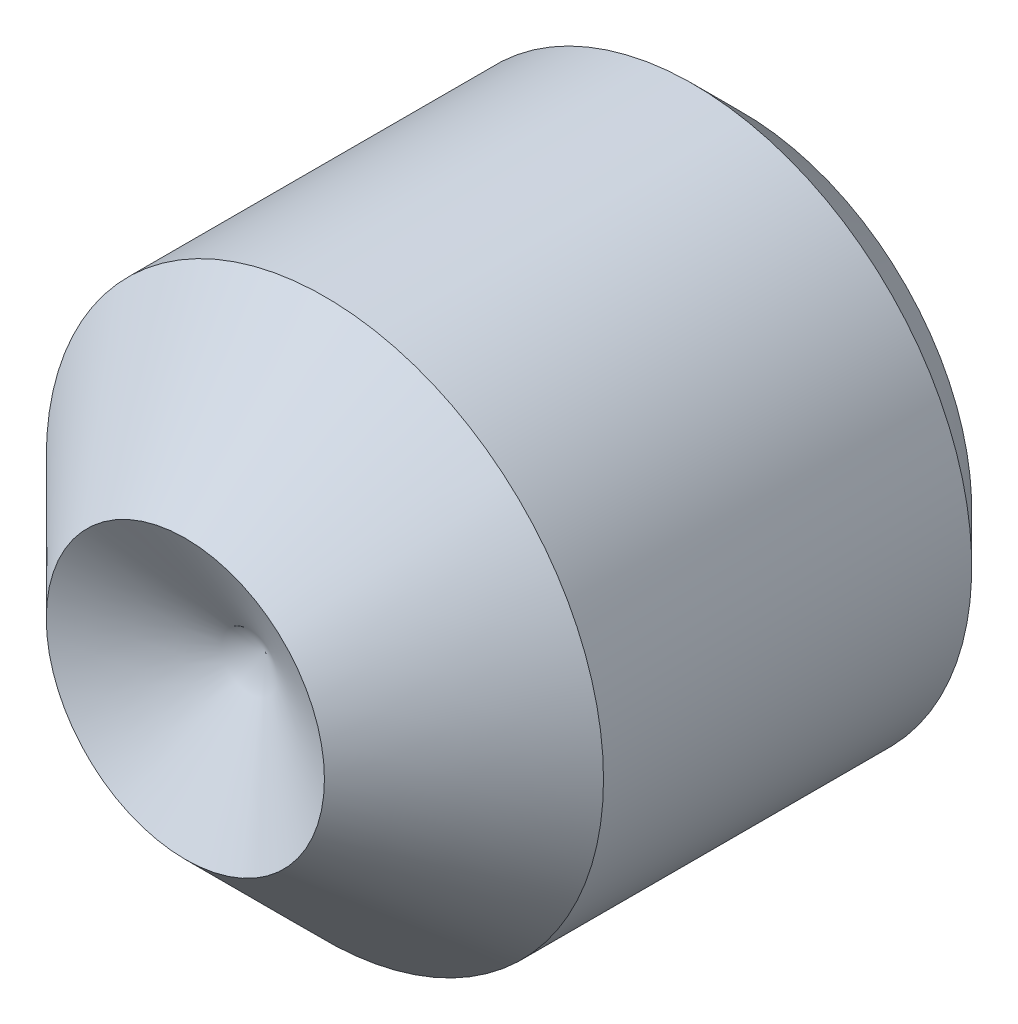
ISO-10303-21;
HEADER;
FILE_DESCRIPTION(('STEP AP214'),'2;1');
FILE_NAME('part.step','',(''),(''),'','','');
FILE_SCHEMA(('AUTOMOTIVE_DESIGN { 1 0 10303 214 1 1 1 1 }'));
ENDSEC;
DATA;
#1=APPLICATION_CONTEXT('core data for automotive mechanical design processes');
#2=APPLICATION_PROTOCOL_DEFINITION('international standard','automotive_design',2000,#1);
#3=PRODUCT_CONTEXT('',#1,'mechanical');
#4=PRODUCT('Part','Part','',(#3));
#5=PRODUCT_RELATED_PRODUCT_CATEGORY('part','',(#4));
#6=PRODUCT_DEFINITION_FORMATION('','',#4);
#7=PRODUCT_DEFINITION_CONTEXT('part definition',#1,'design');
#8=PRODUCT_DEFINITION('design','',#6,#7);
#9=PRODUCT_DEFINITION_SHAPE('','',#8);
#10=(LENGTH_UNIT() NAMED_UNIT(*) SI_UNIT(.MILLI.,.METRE.));
#11=(NAMED_UNIT(*) PLANE_ANGLE_UNIT() SI_UNIT($,.RADIAN.));
#12=(NAMED_UNIT(*) SI_UNIT($,.STERADIAN.) SOLID_ANGLE_UNIT());
#13=UNCERTAINTY_MEASURE_WITH_UNIT(LENGTH_MEASURE(1.E-05),#10,'distance_accuracy_value','');
#14=(GEOMETRIC_REPRESENTATION_CONTEXT(3) GLOBAL_UNCERTAINTY_ASSIGNED_CONTEXT((#13)) GLOBAL_UNIT_ASSIGNED_CONTEXT((#10,
#11,#12)) REPRESENTATION_CONTEXT('',''));
#15=CARTESIAN_POINT('',(0.,0.,0.));
#16=DIRECTION('',(0.,0.,1.));
#17=DIRECTION('',(1.,0.,0.));
#18=AXIS2_PLACEMENT_3D('',#15,#16,#17);
#19=CARTESIAN_POINT('',(0.,0.,-10.585154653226));
#20=DIRECTION('',(0.,0.,-1.));
#21=DIRECTION('',(-1.,0.,0.));
#22=AXIS2_PLACEMENT_3D('',#19,#20,#21);
#23=CYLINDRICAL_SURFACE('',#22,3.96875);
#24=CARTESIAN_POINT('',(0.,0.,0.704850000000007));
#25=DIRECTION('',(0.,0.,-1.));
#26=DIRECTION('',(-1.,0.,0.));
#27=AXIS2_PLACEMENT_3D('',#24,#25,#26);
#28=CIRCLE('',#27,3.96875);
#29=CARTESIAN_POINT('',(-3.96875,0.,0.704850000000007));
#30=VERTEX_POINT('',#29);
#31=EDGE_CURVE('E58',#30,#30,#28,.T.);
#32=ORIENTED_EDGE('',*,*,#31,.F.);
#33=EDGE_LOOP('',(#32));
#34=FACE_BOUND('',#33,.T.);
#35=CARTESIAN_POINT('',(0.,0.,5.94995000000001));
#36=DIRECTION('',(0.,0.,1.));
#37=DIRECTION('',(1.,0.,0.));
#38=AXIS2_PLACEMENT_3D('',#35,#36,#37);
#39=CIRCLE('',#38,3.96875);
#40=CARTESIAN_POINT('',(3.96875,0.,5.94995000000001));
#41=VERTEX_POINT('',#40);
#42=EDGE_CURVE('E188',#41,#41,#39,.T.);
#43=ORIENTED_EDGE('',*,*,#42,.F.);
#44=EDGE_LOOP('',(#43));
#45=FACE_BOUND('',#44,.T.);
#46=ADVANCED_FACE('F49',(#34,#45),#23,.T.);
#47=CARTESIAN_POINT('',(0.,0.,0.));
#48=DIRECTION('',(0.,0.,1.));
#49=DIRECTION('',(1.,0.,0.));
#50=AXIS2_PLACEMENT_3D('',#47,#48,#49);
#51=PLANE('',#50);
#52=DIRECTION('',(-0.5,-0.866025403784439,0.));
#53=VECTOR('',#52,1.);
#54=CARTESIAN_POINT('',(2.29062564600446,0.,0.));
#55=LINE('',#54,#53);
#56=CARTESIAN_POINT('',(2.29062564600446,0.,0.));
#57=VERTEX_POINT('',#56);
#58=CARTESIAN_POINT('',(1.14531282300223,-1.98374,0.));
#59=VERTEX_POINT('',#58);
#60=EDGE_CURVE('E148',#57,#59,#55,.T.);
#61=ORIENTED_EDGE('',*,*,#60,.F.);
#62=DIRECTION('',(0.499999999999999,-0.866025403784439,0.));
#63=VECTOR('',#62,1.);
#64=CARTESIAN_POINT('',(1.14531282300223,1.98374,0.));
#65=LINE('',#64,#63);
#66=CARTESIAN_POINT('',(1.14531282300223,1.98374,0.));
#67=VERTEX_POINT('',#66);
#68=EDGE_CURVE('E65',#67,#57,#65,.T.);
#69=ORIENTED_EDGE('',*,*,#68,.F.);
#70=DIRECTION('',(1.,0.,0.));
#71=VECTOR('',#70,1.);
#72=CARTESIAN_POINT('',(-1.14531282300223,1.98373999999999,0.));
#73=LINE('',#72,#71);
#74=CARTESIAN_POINT('',(-1.14531282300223,1.98373999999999,0.));
#75=VERTEX_POINT('',#74);
#76=EDGE_CURVE('E162',#75,#67,#73,.T.);
#77=ORIENTED_EDGE('',*,*,#76,.F.);
#78=DIRECTION('',(0.5,0.866025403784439,0.));
#79=VECTOR('',#78,1.);
#80=CARTESIAN_POINT('',(-2.29062564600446,0.,0.));
#81=LINE('',#80,#79);
#82=CARTESIAN_POINT('',(-2.29062564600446,0.,0.));
#83=VERTEX_POINT('',#82);
#84=EDGE_CURVE('E159',#83,#75,#81,.T.);
#85=ORIENTED_EDGE('',*,*,#84,.F.);
#86=DIRECTION('',(-0.5,0.866025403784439,0.));
#87=VECTOR('',#86,1.);
#88=CARTESIAN_POINT('',(-1.14531282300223,-1.98374,0.));
#89=LINE('',#88,#87);
#90=CARTESIAN_POINT('',(-1.14531282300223,-1.98374,0.));
#91=VERTEX_POINT('',#90);
#92=EDGE_CURVE('E115',#91,#83,#89,.T.);
#93=ORIENTED_EDGE('',*,*,#92,.F.);
#94=DIRECTION('',(-1.,0.,0.));
#95=VECTOR('',#94,1.);
#96=CARTESIAN_POINT('',(1.14531282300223,-1.98374,0.));
#97=LINE('',#96,#95);
#98=EDGE_CURVE('E153',#59,#91,#97,.T.);
#99=ORIENTED_EDGE('',*,*,#98,.F.);
#100=EDGE_LOOP('',(#61,#69,#77,#85,#93,#99));
#101=FACE_BOUND('',#100,.T.);
#102=CARTESIAN_POINT('',(0.,0.,0.));
#103=DIRECTION('',(0.,0.,-1.));
#104=DIRECTION('',(-1.,0.,0.));
#105=AXIS2_PLACEMENT_3D('',#102,#103,#104);
#106=CIRCLE('',#105,3.2639);
#107=CARTESIAN_POINT('',(-3.2639,0.,0.));
#108=VERTEX_POINT('',#107);
#109=EDGE_CURVE('E11',#108,#108,#106,.T.);
#110=ORIENTED_EDGE('',*,*,#109,.T.);
#111=EDGE_LOOP('',(#110));
#112=FACE_BOUND('',#111,.T.);
#113=ADVANCED_FACE('F51',(#101,#112),#51,.F.);
#114=CARTESIAN_POINT('',(0.,0.,0.704850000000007));
#115=DIRECTION('',(0.,0.,1.));
#116=DIRECTION('',(1.,0.,0.));
#117=AXIS2_PLACEMENT_3D('',#114,#115,#116);
#118=CONICAL_SURFACE('',#117,3.96875,0.785398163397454);
#119=ORIENTED_EDGE('',*,*,#109,.F.);
#120=EDGE_LOOP('',(#119));
#121=FACE_BOUND('',#120,.T.);
#122=ORIENTED_EDGE('',*,*,#31,.T.);
#123=EDGE_LOOP('',(#122));
#124=FACE_BOUND('',#123,.T.);
#125=ADVANCED_FACE('F181',(#121,#124),#118,.T.);
#126=CARTESIAN_POINT('',(1.14531282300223,1.98374,2.5));
#127=DIRECTION('',(0.866025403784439,0.499999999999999,0.));
#128=DIRECTION('',(-0.499999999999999,0.866025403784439,0.));
#129=AXIS2_PLACEMENT_3D('',#126,#127,#128);
#130=PLANE('',#129);
#131=ORIENTED_EDGE('',*,*,#68,.T.);
#132=DIRECTION('',(0.,0.,-1.));
#133=VECTOR('',#132,1.);
#134=CARTESIAN_POINT('',(2.29062564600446,0.,2.5));
#135=LINE('',#134,#133);
#136=CARTESIAN_POINT('',(2.29062564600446,0.,2.5));
#137=VERTEX_POINT('',#136);
#138=EDGE_CURVE('E96',#137,#57,#135,.T.);
#139=ORIENTED_EDGE('',*,*,#138,.F.);
#140=DIRECTION('',(0.499999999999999,-0.866025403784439,0.));
#141=VECTOR('',#140,1.);
#142=CARTESIAN_POINT('',(1.14531282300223,1.98374,2.5));
#143=LINE('',#142,#141);
#144=CARTESIAN_POINT('',(1.14531282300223,1.98374,2.5));
#145=VERTEX_POINT('',#144);
#146=EDGE_CURVE('E165',#145,#137,#143,.T.);
#147=ORIENTED_EDGE('',*,*,#146,.F.);
#148=DIRECTION('',(0.,0.,-1.));
#149=VECTOR('',#148,1.);
#150=CARTESIAN_POINT('',(1.14531282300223,1.98374,2.5));
#151=LINE('',#150,#149);
#152=EDGE_CURVE('E73',#145,#67,#151,.T.);
#153=ORIENTED_EDGE('',*,*,#152,.T.);
#154=EDGE_LOOP('',(#131,#139,#147,#153));
#155=FACE_BOUND('',#154,.T.);
#156=ADVANCED_FACE('F211',(#155),#130,.F.);
#157=CARTESIAN_POINT('',(-1.14531282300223,1.98373999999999,2.5));
#158=DIRECTION('',(0.,1.,0.));
#159=DIRECTION('',(-1.,0.,0.));
#160=AXIS2_PLACEMENT_3D('',#157,#158,#159);
#161=PLANE('',#160);
#162=ORIENTED_EDGE('',*,*,#76,.T.);
#163=ORIENTED_EDGE('',*,*,#152,.F.);
#164=DIRECTION('',(1.,0.,0.));
#165=VECTOR('',#164,1.);
#166=CARTESIAN_POINT('',(-1.14531282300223,1.98373999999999,2.5));
#167=LINE('',#166,#165);
#168=CARTESIAN_POINT('',(-1.14531282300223,1.98373999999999,2.5));
#169=VERTEX_POINT('',#168);
#170=EDGE_CURVE('E129',#169,#145,#167,.T.);
#171=ORIENTED_EDGE('',*,*,#170,.F.);
#172=DIRECTION('',(0.,0.,-1.));
#173=VECTOR('',#172,1.);
#174=CARTESIAN_POINT('',(-1.14531282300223,1.98373999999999,2.5));
#175=LINE('',#174,#173);
#176=EDGE_CURVE('E120',#169,#75,#175,.T.);
#177=ORIENTED_EDGE('',*,*,#176,.T.);
#178=EDGE_LOOP('',(#162,#163,#171,#177));
#179=FACE_BOUND('',#178,.T.);
#180=ADVANCED_FACE('F209',(#179),#161,.F.);
#181=CARTESIAN_POINT('',(-2.29062564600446,0.,2.5));
#182=DIRECTION('',(-0.866025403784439,0.5,0.));
#183=DIRECTION('',(-0.5,-0.866025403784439,0.));
#184=AXIS2_PLACEMENT_3D('',#181,#182,#183);
#185=PLANE('',#184);
#186=ORIENTED_EDGE('',*,*,#84,.T.);
#187=ORIENTED_EDGE('',*,*,#176,.F.);
#188=DIRECTION('',(0.5,0.866025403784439,0.));
#189=VECTOR('',#188,1.);
#190=CARTESIAN_POINT('',(-2.29062564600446,0.,2.5));
#191=LINE('',#190,#189);
#192=CARTESIAN_POINT('',(-2.29062564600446,0.,2.5));
#193=VERTEX_POINT('',#192);
#194=EDGE_CURVE('E124',#193,#169,#191,.T.);
#195=ORIENTED_EDGE('',*,*,#194,.F.);
#196=DIRECTION('',(0.,0.,-1.));
#197=VECTOR('',#196,1.);
#198=CARTESIAN_POINT('',(-2.29062564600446,0.,2.5));
#199=LINE('',#198,#197);
#200=EDGE_CURVE('E108',#193,#83,#199,.T.);
#201=ORIENTED_EDGE('',*,*,#200,.T.);
#202=EDGE_LOOP('',(#186,#187,#195,#201));
#203=FACE_BOUND('',#202,.T.);
#204=ADVANCED_FACE('F125',(#203),#185,.F.);
#205=CARTESIAN_POINT('',(-1.14531282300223,-1.98374,2.5));
#206=DIRECTION('',(-0.866025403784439,-0.5,0.));
#207=DIRECTION('',(0.5,-0.866025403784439,0.));
#208=AXIS2_PLACEMENT_3D('',#205,#206,#207);
#209=PLANE('',#208);
#210=ORIENTED_EDGE('',*,*,#92,.T.);
#211=ORIENTED_EDGE('',*,*,#200,.F.);
#212=DIRECTION('',(-0.5,0.866025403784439,0.));
#213=VECTOR('',#212,1.);
#214=CARTESIAN_POINT('',(-1.14531282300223,-1.98374,2.5));
#215=LINE('',#214,#213);
#216=CARTESIAN_POINT('',(-1.14531282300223,-1.98374,2.5));
#217=VERTEX_POINT('',#216);
#218=EDGE_CURVE('E112',#217,#193,#215,.T.);
#219=ORIENTED_EDGE('',*,*,#218,.F.);
#220=DIRECTION('',(0.,0.,-1.));
#221=VECTOR('',#220,1.);
#222=CARTESIAN_POINT('',(-1.14531282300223,-1.98374,2.5));
#223=LINE('',#222,#221);
#224=EDGE_CURVE('E121',#217,#91,#223,.T.);
#225=ORIENTED_EDGE('',*,*,#224,.T.);
#226=EDGE_LOOP('',(#210,#211,#219,#225));
#227=FACE_BOUND('',#226,.T.);
#228=ADVANCED_FACE('F110',(#227),#209,.F.);
#229=CARTESIAN_POINT('',(1.14531282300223,-1.98374,2.5));
#230=DIRECTION('',(0.,-1.,0.));
#231=DIRECTION('',(1.,0.,0.));
#232=AXIS2_PLACEMENT_3D('',#229,#230,#231);
#233=PLANE('',#232);
#234=ORIENTED_EDGE('',*,*,#98,.T.);
#235=ORIENTED_EDGE('',*,*,#224,.F.);
#236=DIRECTION('',(-1.,0.,0.));
#237=VECTOR('',#236,1.);
#238=CARTESIAN_POINT('',(1.14531282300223,-1.98374,2.5));
#239=LINE('',#238,#237);
#240=CARTESIAN_POINT('',(1.14531282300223,-1.98374,2.5));
#241=VERTEX_POINT('',#240);
#242=EDGE_CURVE('E135',#241,#217,#239,.T.);
#243=ORIENTED_EDGE('',*,*,#242,.F.);
#244=DIRECTION('',(0.,0.,-1.));
#245=VECTOR('',#244,1.);
#246=CARTESIAN_POINT('',(1.14531282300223,-1.98374,2.5));
#247=LINE('',#246,#245);
#248=EDGE_CURVE('E172',#241,#59,#247,.T.);
#249=ORIENTED_EDGE('',*,*,#248,.T.);
#250=EDGE_LOOP('',(#234,#235,#243,#249));
#251=FACE_BOUND('',#250,.T.);
#252=ADVANCED_FACE('F205',(#251),#233,.F.);
#253=CARTESIAN_POINT('',(2.29062564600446,0.,2.5));
#254=DIRECTION('',(0.866025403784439,-0.5,0.));
#255=DIRECTION('',(0.5,0.866025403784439,0.));
#256=AXIS2_PLACEMENT_3D('',#253,#254,#255);
#257=PLANE('',#256);
#258=ORIENTED_EDGE('',*,*,#60,.T.);
#259=ORIENTED_EDGE('',*,*,#248,.F.);
#260=DIRECTION('',(-0.5,-0.866025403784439,0.));
#261=VECTOR('',#260,1.);
#262=CARTESIAN_POINT('',(2.29062564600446,0.,2.5));
#263=LINE('',#262,#261);
#264=EDGE_CURVE('E140',#137,#241,#263,.T.);
#265=ORIENTED_EDGE('',*,*,#264,.F.);
#266=ORIENTED_EDGE('',*,*,#138,.T.);
#267=EDGE_LOOP('',(#258,#259,#265,#266));
#268=FACE_BOUND('',#267,.T.);
#269=ADVANCED_FACE('F201',(#268),#257,.F.);
#270=CARTESIAN_POINT('',(3.43593846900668,-1.98374,2.5));
#271=DIRECTION('',(0.,0.,-1.));
#272=DIRECTION('',(-1.,0.,0.));
#273=AXIS2_PLACEMENT_3D('',#270,#271,#272);
#274=PLANE('',#273);
#275=ORIENTED_EDGE('',*,*,#146,.T.);
#276=ORIENTED_EDGE('',*,*,#264,.T.);
#277=ORIENTED_EDGE('',*,*,#242,.T.);
#278=ORIENTED_EDGE('',*,*,#218,.T.);
#279=ORIENTED_EDGE('',*,*,#194,.T.);
#280=ORIENTED_EDGE('',*,*,#170,.T.);
#281=EDGE_LOOP('',(#275,#276,#277,#278,#279,#280));
#282=FACE_BOUND('',#281,.T.);
#283=ADVANCED_FACE('F132',(#282),#274,.T.);
#284=CARTESIAN_POINT('',(0.,0.,6.79365364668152));
#285=DIRECTION('',(0.,0.,1.));
#286=DIRECTION('',(1.,0.,0.));
#287=AXIS2_PLACEMENT_3D('',#284,#285,#286);
#288=CONICAL_SURFACE('',#287,0.,1.0471975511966);
#289=CARTESIAN_POINT('',(0.,0.,7.93750000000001));
#290=DIRECTION('',(0.,0.,1.));
#291=DIRECTION('',(1.,0.,0.));
#292=AXIS2_PLACEMENT_3D('',#289,#290,#291);
#293=CIRCLE('',#292,1.9812);
#294=CARTESIAN_POINT('',(1.9812,0.,7.93750000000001));
#295=VERTEX_POINT('',#294);
#296=EDGE_CURVE('E149',#295,#295,#293,.T.);
#297=ORIENTED_EDGE('',*,*,#296,.T.);
#298=EDGE_LOOP('',(#297));
#299=FACE_BOUND('',#298,.T.);
#300=CARTESIAN_POINT('',(0.,0.,6.79365364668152));
#301=VERTEX_POINT('',#300);
#302=VERTEX_LOOP('',#301);
#303=FACE_BOUND('',#302,.T.);
#304=ADVANCED_FACE('F284',(#299,#303),#288,.F.);
#305=CARTESIAN_POINT('',(0.,0.,7.93750000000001));
#306=DIRECTION('',(0.,0.,-1.));
#307=DIRECTION('',(-1.,0.,0.));
#308=AXIS2_PLACEMENT_3D('',#305,#306,#307);
#309=CONICAL_SURFACE('',#308,1.9812,0.785398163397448);
#310=ORIENTED_EDGE('',*,*,#42,.T.);
#311=EDGE_LOOP('',(#310));
#312=FACE_BOUND('',#311,.T.);
#313=ORIENTED_EDGE('',*,*,#296,.F.);
#314=EDGE_LOOP('',(#313));
#315=FACE_BOUND('',#314,.T.);
#316=ADVANCED_FACE('F294',(#312,#315),#309,.T.);
#317=CLOSED_SHELL('',(#46,#113,#125,#156,#180,#204,#228,#252,#269,#283,#304,#316));
#318=MANIFOLD_SOLID_BREP('B2',#317);
#319=ADVANCED_BREP_SHAPE_REPRESENTATION('',(#18,#318),#14);
#320=SHAPE_DEFINITION_REPRESENTATION(#9,#319);
ENDSEC;
END-ISO-10303-21;
